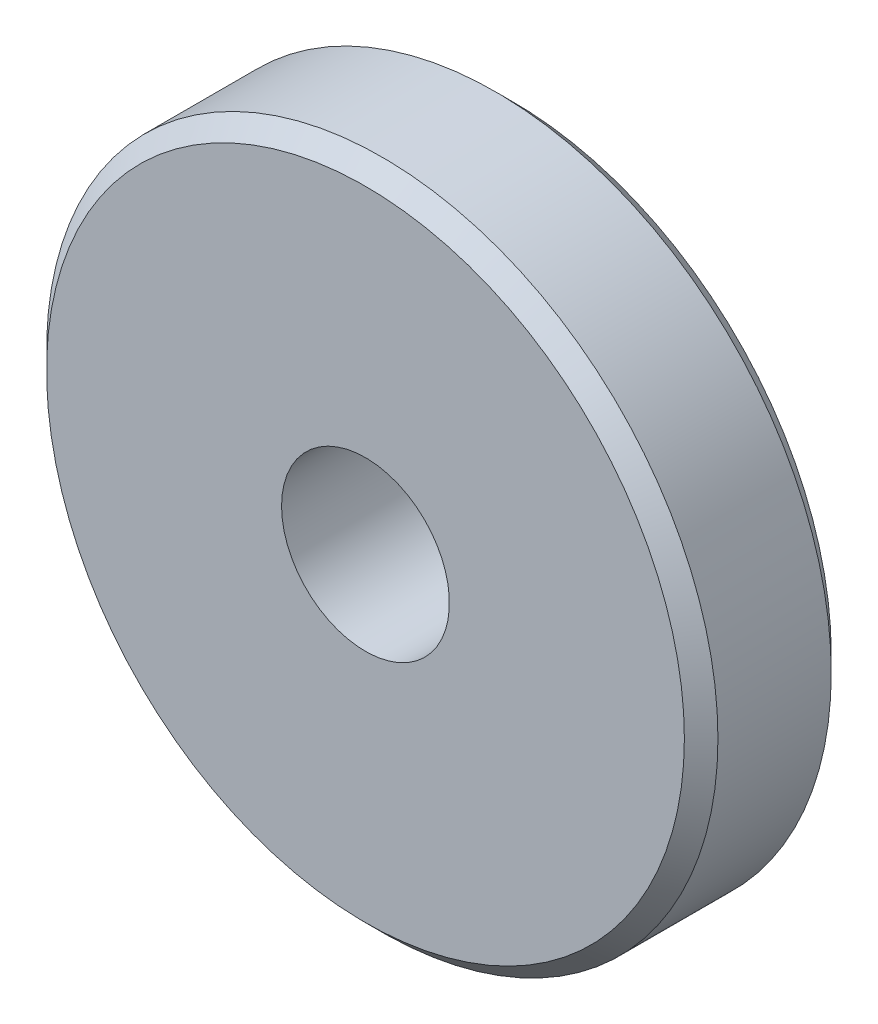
ISO-10303-21;
HEADER;
FILE_DESCRIPTION(('STEP AP214'),'2;1');
FILE_NAME('part.step','',(''),(''),'','','');
FILE_SCHEMA(('AUTOMOTIVE_DESIGN { 1 0 10303 214 1 1 1 1 }'));
ENDSEC;
DATA;
#1=APPLICATION_CONTEXT('core data for automotive mechanical design processes');
#2=APPLICATION_PROTOCOL_DEFINITION('international standard','automotive_design',2000,#1);
#3=PRODUCT_CONTEXT('',#1,'mechanical');
#4=PRODUCT('Part','Part','',(#3));
#5=PRODUCT_RELATED_PRODUCT_CATEGORY('part','',(#4));
#6=PRODUCT_DEFINITION_FORMATION('','',#4);
#7=PRODUCT_DEFINITION_CONTEXT('part definition',#1,'design');
#8=PRODUCT_DEFINITION('design','',#6,#7);
#9=PRODUCT_DEFINITION_SHAPE('','',#8);
#10=(LENGTH_UNIT() NAMED_UNIT(*) SI_UNIT(.MILLI.,.METRE.));
#11=(NAMED_UNIT(*) PLANE_ANGLE_UNIT() SI_UNIT($,.RADIAN.));
#12=(NAMED_UNIT(*) SI_UNIT($,.STERADIAN.) SOLID_ANGLE_UNIT());
#13=UNCERTAINTY_MEASURE_WITH_UNIT(LENGTH_MEASURE(1.E-05),#10,'distance_accuracy_value','');
#14=(GEOMETRIC_REPRESENTATION_CONTEXT(3) GLOBAL_UNCERTAINTY_ASSIGNED_CONTEXT((#13)) GLOBAL_UNIT_ASSIGNED_CONTEXT((#10,
#11,#12)) REPRESENTATION_CONTEXT('',''));
#15=CARTESIAN_POINT('',(0.,0.,0.));
#16=DIRECTION('',(0.,0.,1.));
#17=DIRECTION('',(1.,0.,0.));
#18=AXIS2_PLACEMENT_3D('',#15,#16,#17);
#19=CARTESIAN_POINT('',(0.,0.,0.5));
#20=DIRECTION('',(0.,0.,-1.));
#21=DIRECTION('',(-1.,0.,0.));
#22=AXIS2_PLACEMENT_3D('',#19,#20,#21);
#23=CYLINDRICAL_SURFACE('',#22,4.);
#24=CARTESIAN_POINT('',(0.,0.,0.01));
#25=DIRECTION('',(0.,0.,1.));
#26=DIRECTION('',(1.,0.,0.));
#27=AXIS2_PLACEMENT_3D('',#24,#25,#26);
#28=CIRCLE('',#27,4.);
#29=CARTESIAN_POINT('',(4.,0.,0.01));
#30=VERTEX_POINT('',#29);
#31=EDGE_CURVE('E8',#30,#30,#28,.F.);
#32=ORIENTED_EDGE('',*,*,#31,.T.);
#33=EDGE_LOOP('',(#32));
#34=FACE_BOUND('',#33,.T.);
#35=CARTESIAN_POINT('',(0.,0.,0.));
#36=DIRECTION('',(0.,0.,1.));
#37=DIRECTION('',(1.,0.,0.));
#38=AXIS2_PLACEMENT_3D('',#35,#36,#37);
#39=CIRCLE('',#38,4.);
#40=CARTESIAN_POINT('',(4.,0.,0.));
#41=VERTEX_POINT('',#40);
#42=EDGE_CURVE('E38',#41,#41,#39,.T.);
#43=ORIENTED_EDGE('',*,*,#42,.T.);
#44=EDGE_LOOP('',(#43));
#45=FACE_BOUND('',#44,.T.);
#46=ADVANCED_FACE('F12',(#34,#45),#23,.T.);
#47=CARTESIAN_POINT('',(0.,0.,0.));
#48=DIRECTION('',(0.,0.,1.));
#49=DIRECTION('',(1.,0.,0.));
#50=AXIS2_PLACEMENT_3D('',#47,#48,#49);
#51=PLANE('',#50);
#52=CARTESIAN_POINT('',(0.,0.,0.));
#53=DIRECTION('',(0.,0.,-1.));
#54=DIRECTION('',(-1.,0.,0.));
#55=AXIS2_PLACEMENT_3D('',#52,#53,#54);
#56=CIRCLE('',#55,2.);
#57=CARTESIAN_POINT('',(-2.,0.,0.));
#58=VERTEX_POINT('',#57);
#59=EDGE_CURVE('E42',#58,#58,#56,.T.);
#60=ORIENTED_EDGE('',*,*,#59,.F.);
#61=EDGE_LOOP('',(#60));
#62=FACE_BOUND('',#61,.T.);
#63=ORIENTED_EDGE('',*,*,#42,.F.);
#64=EDGE_LOOP('',(#63));
#65=FACE_BOUND('',#64,.T.);
#66=ADVANCED_FACE('F57',(#62,#65),#51,.F.);
#67=CARTESIAN_POINT('',(0.,0.,0.5));
#68=DIRECTION('',(0.,0.,1.));
#69=DIRECTION('',(1.,0.,0.));
#70=AXIS2_PLACEMENT_3D('',#67,#68,#69);
#71=PLANE('',#70);
#72=CARTESIAN_POINT('',(0.,0.,0.5));
#73=DIRECTION('',(0.,0.,1.));
#74=DIRECTION('',(1.,0.,0.));
#75=AXIS2_PLACEMENT_3D('',#72,#73,#74);
#76=CIRCLE('',#75,4.49);
#77=CARTESIAN_POINT('',(4.49,0.,0.5));
#78=VERTEX_POINT('',#77);
#79=EDGE_CURVE('E19',#78,#78,#76,.T.);
#80=ORIENTED_EDGE('',*,*,#79,.T.);
#81=EDGE_LOOP('',(#80));
#82=FACE_BOUND('',#81,.T.);
#83=CARTESIAN_POINT('',(0.,0.,0.5));
#84=DIRECTION('',(0.,0.,1.));
#85=DIRECTION('',(1.,0.,0.));
#86=AXIS2_PLACEMENT_3D('',#83,#84,#85);
#87=CIRCLE('',#86,7.6);
#88=CARTESIAN_POINT('',(7.6,0.,0.5));
#89=VERTEX_POINT('',#88);
#90=EDGE_CURVE('E27',#89,#89,#87,.F.);
#91=ORIENTED_EDGE('',*,*,#90,.T.);
#92=EDGE_LOOP('',(#91));
#93=FACE_BOUND('',#92,.T.);
#94=ADVANCED_FACE('F60',(#82,#93),#71,.F.);
#95=CARTESIAN_POINT('',(0.,0.,4.));
#96=DIRECTION('',(0.,0.,-1.));
#97=DIRECTION('',(-1.,0.,0.));
#98=AXIS2_PLACEMENT_3D('',#95,#96,#97);
#99=CYLINDRICAL_SURFACE('',#98,8.);
#100=CARTESIAN_POINT('',(0.,0.,0.9));
#101=DIRECTION('',(0.,0.,1.));
#102=DIRECTION('',(1.,0.,0.));
#103=AXIS2_PLACEMENT_3D('',#100,#101,#102);
#104=CIRCLE('',#103,8.);
#105=CARTESIAN_POINT('',(8.,0.,0.9));
#106=VERTEX_POINT('',#105);
#107=EDGE_CURVE('E32',#106,#106,#104,.T.);
#108=ORIENTED_EDGE('',*,*,#107,.T.);
#109=EDGE_LOOP('',(#108));
#110=FACE_BOUND('',#109,.T.);
#111=CARTESIAN_POINT('',(0.,0.,3.6));
#112=DIRECTION('',(0.,0.,1.));
#113=DIRECTION('',(1.,0.,0.));
#114=AXIS2_PLACEMENT_3D('',#111,#112,#113);
#115=CIRCLE('',#114,8.);
#116=CARTESIAN_POINT('',(8.,0.,3.6));
#117=VERTEX_POINT('',#116);
#118=EDGE_CURVE('E35',#117,#117,#115,.F.);
#119=ORIENTED_EDGE('',*,*,#118,.T.);
#120=EDGE_LOOP('',(#119));
#121=FACE_BOUND('',#120,.T.);
#122=ADVANCED_FACE('F87',(#110,#121),#99,.T.);
#123=CARTESIAN_POINT('',(0.,0.,4.));
#124=DIRECTION('',(0.,0.,1.));
#125=DIRECTION('',(1.,0.,0.));
#126=AXIS2_PLACEMENT_3D('',#123,#124,#125);
#127=PLANE('',#126);
#128=CARTESIAN_POINT('',(0.,0.,4.));
#129=DIRECTION('',(0.,0.,1.));
#130=DIRECTION('',(1.,0.,0.));
#131=AXIS2_PLACEMENT_3D('',#128,#129,#130);
#132=CIRCLE('',#131,7.6);
#133=CARTESIAN_POINT('',(7.6,0.,4.));
#134=VERTEX_POINT('',#133);
#135=EDGE_CURVE('E23',#134,#134,#132,.T.);
#136=ORIENTED_EDGE('',*,*,#135,.T.);
#137=EDGE_LOOP('',(#136));
#138=FACE_BOUND('',#137,.T.);
#139=CARTESIAN_POINT('',(0.,0.,4.));
#140=DIRECTION('',(0.,0.,-1.));
#141=DIRECTION('',(-1.,0.,0.));
#142=AXIS2_PLACEMENT_3D('',#139,#140,#141);
#143=CIRCLE('',#142,2.);
#144=CARTESIAN_POINT('',(-2.,0.,4.));
#145=VERTEX_POINT('',#144);
#146=EDGE_CURVE('E41',#145,#145,#143,.T.);
#147=ORIENTED_EDGE('',*,*,#146,.T.);
#148=EDGE_LOOP('',(#147));
#149=FACE_BOUND('',#148,.T.);
#150=ADVANCED_FACE('F48',(#138,#149),#127,.T.);
#151=CARTESIAN_POINT('',(0.,0.,4.));
#152=DIRECTION('',(0.,0.,-1.));
#153=DIRECTION('',(-1.,0.,0.));
#154=AXIS2_PLACEMENT_3D('',#151,#152,#153);
#155=CYLINDRICAL_SURFACE('',#154,2.);
#156=ORIENTED_EDGE('',*,*,#146,.F.);
#157=EDGE_LOOP('',(#156));
#158=FACE_BOUND('',#157,.T.);
#159=ORIENTED_EDGE('',*,*,#59,.T.);
#160=EDGE_LOOP('',(#159));
#161=FACE_BOUND('',#160,.T.);
#162=ADVANCED_FACE('F50',(#158,#161),#155,.F.);
#163=CARTESIAN_POINT('',(0.,0.,0.9));
#164=DIRECTION('',(0.,0.,1.));
#165=DIRECTION('',(1.,0.,0.));
#166=AXIS2_PLACEMENT_3D('',#163,#164,#165);
#167=CONICAL_SURFACE('',#166,8.,0.78539816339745);
#168=ORIENTED_EDGE('',*,*,#90,.F.);
#169=EDGE_LOOP('',(#168));
#170=FACE_BOUND('',#169,.T.);
#171=ORIENTED_EDGE('',*,*,#107,.F.);
#172=EDGE_LOOP('',(#171));
#173=FACE_BOUND('',#172,.T.);
#174=ADVANCED_FACE('F53',(#170,#173),#167,.T.);
#175=CARTESIAN_POINT('',(0.,0.,4.));
#176=DIRECTION('',(0.,0.,-1.));
#177=DIRECTION('',(-1.,0.,0.));
#178=AXIS2_PLACEMENT_3D('',#175,#176,#177);
#179=CONICAL_SURFACE('',#178,7.6,0.785398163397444);
#180=ORIENTED_EDGE('',*,*,#118,.F.);
#181=EDGE_LOOP('',(#180));
#182=FACE_BOUND('',#181,.T.);
#183=ORIENTED_EDGE('',*,*,#135,.F.);
#184=EDGE_LOOP('',(#183));
#185=FACE_BOUND('',#184,.T.);
#186=ADVANCED_FACE('F73',(#182,#185),#179,.T.);
#187=CARTESIAN_POINT('',(0.,0.,0.01));
#188=DIRECTION('',(0.,0.,1.));
#189=DIRECTION('',(1.,0.,0.));
#190=AXIS2_PLACEMENT_3D('',#187,#188,#189);
#191=TOROIDAL_SURFACE('',#190,4.49,0.49);
#192=ORIENTED_EDGE('',*,*,#31,.F.);
#193=EDGE_LOOP('',(#192));
#194=FACE_BOUND('',#193,.T.);
#195=ORIENTED_EDGE('',*,*,#79,.F.);
#196=EDGE_LOOP('',(#195));
#197=FACE_BOUND('',#196,.T.);
#198=ADVANCED_FACE('F14',(#194,#197),#191,.F.);
#199=CLOSED_SHELL('',(#46,#66,#94,#122,#150,#162,#174,#186,#198));
#200=MANIFOLD_SOLID_BREP('B1',#199);
#201=ADVANCED_BREP_SHAPE_REPRESENTATION('',(#18,#200),#14);
#202=SHAPE_DEFINITION_REPRESENTATION(#9,#201);
ENDSEC;
END-ISO-10303-21;
